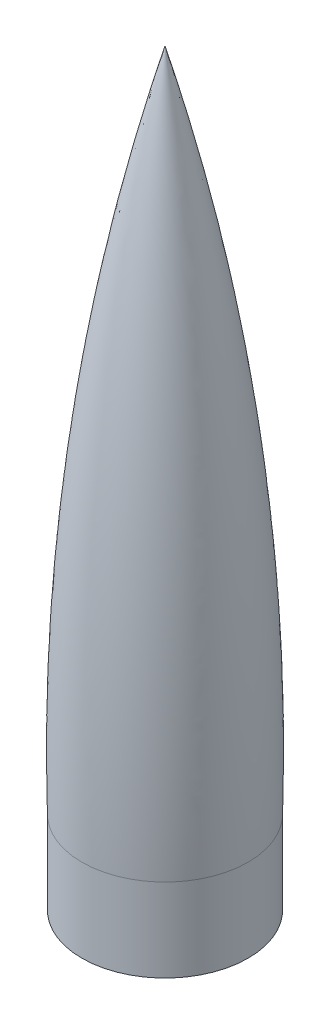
ISO-10303-21;
HEADER;
FILE_DESCRIPTION(('STEP AP214'),'2;1');
FILE_NAME('part.step','',(''),(''),'','','');
FILE_SCHEMA(('AUTOMOTIVE_DESIGN { 1 0 10303 214 1 1 1 1 }'));
ENDSEC;
DATA;
#1=APPLICATION_CONTEXT('core data for automotive mechanical design processes');
#2=APPLICATION_PROTOCOL_DEFINITION('international standard','automotive_design',2000,#1);
#3=PRODUCT_CONTEXT('',#1,'mechanical');
#4=PRODUCT('Part','Part','',(#3));
#5=PRODUCT_RELATED_PRODUCT_CATEGORY('part','',(#4));
#6=PRODUCT_DEFINITION_FORMATION('','',#4);
#7=PRODUCT_DEFINITION_CONTEXT('part definition',#1,'design');
#8=PRODUCT_DEFINITION('design','',#6,#7);
#9=PRODUCT_DEFINITION_SHAPE('','',#8);
#10=(LENGTH_UNIT() NAMED_UNIT(*) SI_UNIT(.MILLI.,.METRE.));
#11=(NAMED_UNIT(*) PLANE_ANGLE_UNIT() SI_UNIT($,.RADIAN.));
#12=(NAMED_UNIT(*) SI_UNIT($,.STERADIAN.) SOLID_ANGLE_UNIT());
#13=UNCERTAINTY_MEASURE_WITH_UNIT(LENGTH_MEASURE(1.E-05),#10,'distance_accuracy_value','');
#14=(GEOMETRIC_REPRESENTATION_CONTEXT(3) GLOBAL_UNCERTAINTY_ASSIGNED_CONTEXT((#13)) GLOBAL_UNIT_ASSIGNED_CONTEXT((#10,
#11,#12)) REPRESENTATION_CONTEXT('',''));
#15=CARTESIAN_POINT('',(0.,0.,0.));
#16=DIRECTION('',(0.,0.,1.));
#17=DIRECTION('',(1.,0.,0.));
#18=AXIS2_PLACEMENT_3D('',#15,#16,#17);
#19=CARTESIAN_POINT('',(0.,25.363989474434,-997.238084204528));
#20=DIRECTION('',(-1.,0.,0.));
#21=DIRECTION('',(0.,0.,1.));
#22=AXIS2_PLACEMENT_3D('',#19,#20,#21);
#23=CIRCLE('',#22,1035.64872450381);
#24=TRIMMED_CURVE('',#23,(PARAMETER_VALUE(-0.273203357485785)),
(PARAMETER_VALUE(0.273203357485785)),.T.,.PARAMETER.);
#25=CARTESIAN_POINT('',(0.,25.363989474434,0.));
#26=DIRECTION('',(0.,1.,0.));
#27=AXIS1_PLACEMENT('',#25,#26);
#28=SURFACE_OF_REVOLUTION('',#24,#27);
#29=CARTESIAN_POINT('',(0.,304.8,0.));
#30=VERTEX_POINT('',#29);
#31=VERTEX_LOOP('',#30);
#32=FACE_BOUND('',#31,.T.);
#33=CARTESIAN_POINT('',(0.,0.,0.));
#34=DIRECTION('',(0.,-1.,0.));
#35=DIRECTION('',(0.,0.,-1.));
#36=AXIS2_PLACEMENT_3D('',#33,#34,#35);
#37=CIRCLE('',#36,38.1);
#38=CARTESIAN_POINT('',(0.,0.,38.1));
#39=VERTEX_POINT('',#38);
#40=EDGE_CURVE('E85',#39,#39,#37,.T.);
#41=ORIENTED_EDGE('',*,*,#40,.F.);
#42=EDGE_LOOP('',(#41));
#43=FACE_BOUND('',#42,.T.);
#44=ADVANCED_FACE('F45',(#32,#43),#28,.T.);
#45=CARTESIAN_POINT('',(0.,-38.1,0.));
#46=DIRECTION('',(0.,-1.,0.));
#47=DIRECTION('',(0.,0.,-1.));
#48=AXIS2_PLACEMENT_3D('',#45,#46,#47);
#49=PLANE('',#48);
#50=CARTESIAN_POINT('',(0.,-38.1,0.));
#51=DIRECTION('',(0.,-1.,0.));
#52=DIRECTION('',(0.,0.,-1.));
#53=AXIS2_PLACEMENT_3D('',#50,#51,#52);
#54=CIRCLE('',#53,38.1);
#55=CARTESIAN_POINT('',(0.,-38.1,38.1));
#56=VERTEX_POINT('',#55);
#57=EDGE_CURVE('E53',#56,#56,#54,.T.);
#58=ORIENTED_EDGE('',*,*,#57,.T.);
#59=EDGE_LOOP('',(#58));
#60=FACE_BOUND('',#59,.T.);
#61=CARTESIAN_POINT('',(0.,-38.1,0.));
#62=DIRECTION('',(0.,-1.,0.));
#63=DIRECTION('',(0.,0.,-1.));
#64=AXIS2_PLACEMENT_3D('',#61,#62,#63);
#65=CIRCLE('',#64,34.9240444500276);
#66=CARTESIAN_POINT('',(0.,-38.1,34.9240444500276));
#67=VERTEX_POINT('',#66);
#68=EDGE_CURVE('E88',#67,#67,#65,.T.);
#69=ORIENTED_EDGE('',*,*,#68,.F.);
#70=EDGE_LOOP('',(#69));
#71=FACE_BOUND('',#70,.T.);
#72=ADVANCED_FACE('F72',(#60,#71),#49,.T.);
#73=CARTESIAN_POINT('',(0.,-38.1,0.));
#74=DIRECTION('',(0.,1.,0.));
#75=DIRECTION('',(0.,0.,1.));
#76=AXIS2_PLACEMENT_3D('',#73,#74,#75);
#77=CYLINDRICAL_SURFACE('',#76,38.1);
#78=CARTESIAN_POINT('',(0.,-38.1,38.1));
#79=CARTESIAN_POINT('',(0.,-37.703125,38.1));
#80=CARTESIAN_POINT('',(0.,-37.30625,38.1));
#81=CARTESIAN_POINT('',(0.,-36.5125,38.1));
#82=CARTESIAN_POINT('',(0.,-36.115625,38.1));
#83=CARTESIAN_POINT('',(0.,-35.321875,38.1));
#84=CARTESIAN_POINT('',(0.,-34.925,38.1));
#85=CARTESIAN_POINT('',(0.,-34.13125,38.1));
#86=CARTESIAN_POINT('',(0.,-33.734375,38.1));
#87=CARTESIAN_POINT('',(0.,-32.940625,38.1));
#88=CARTESIAN_POINT('',(0.,-32.54375,38.1));
#89=CARTESIAN_POINT('',(0.,-31.75,38.1));
#90=CARTESIAN_POINT('',(0.,-31.353125,38.1));
#91=CARTESIAN_POINT('',(0.,-30.559375,38.1));
#92=CARTESIAN_POINT('',(0.,-30.1625,38.1));
#93=CARTESIAN_POINT('',(0.,-29.36875,38.1));
#94=CARTESIAN_POINT('',(0.,-28.971875,38.1));
#95=CARTESIAN_POINT('',(0.,-28.178125,38.1));
#96=CARTESIAN_POINT('',(0.,-27.78125,38.1));
#97=CARTESIAN_POINT('',(0.,-26.9875,38.1));
#98=CARTESIAN_POINT('',(0.,-26.590625,38.1));
#99=CARTESIAN_POINT('',(0.,-25.796875,38.1));
#100=CARTESIAN_POINT('',(0.,-25.4,38.1));
#101=CARTESIAN_POINT('',(0.,-24.60625,38.1));
#102=CARTESIAN_POINT('',(0.,-24.209375,38.1));
#103=CARTESIAN_POINT('',(0.,-23.415625,38.1));
#104=CARTESIAN_POINT('',(0.,-23.01875,38.1));
#105=CARTESIAN_POINT('',(0.,-22.225,38.1));
#106=CARTESIAN_POINT('',(0.,-21.828125,38.1));
#107=CARTESIAN_POINT('',(0.,-21.034375,38.1));
#108=CARTESIAN_POINT('',(0.,-20.6375,38.1));
#109=CARTESIAN_POINT('',(0.,-19.84375,38.1));
#110=CARTESIAN_POINT('',(0.,-19.446875,38.1));
#111=CARTESIAN_POINT('',(0.,-18.653125,38.1));
#112=CARTESIAN_POINT('',(0.,-18.25625,38.1));
#113=CARTESIAN_POINT('',(0.,-17.4625,38.1));
#114=CARTESIAN_POINT('',(0.,-17.065625,38.1));
#115=CARTESIAN_POINT('',(0.,-16.271875,38.1));
#116=CARTESIAN_POINT('',(0.,-15.875,38.1));
#117=CARTESIAN_POINT('',(0.,-15.08125,38.1));
#118=CARTESIAN_POINT('',(0.,-14.684375,38.1));
#119=CARTESIAN_POINT('',(0.,-13.890625,38.1));
#120=CARTESIAN_POINT('',(0.,-13.49375,38.1));
#121=CARTESIAN_POINT('',(0.,-12.7,38.1));
#122=CARTESIAN_POINT('',(0.,-12.303125,38.1));
#123=CARTESIAN_POINT('',(0.,-11.509375,38.1));
#124=CARTESIAN_POINT('',(0.,-11.1125,38.1));
#125=CARTESIAN_POINT('',(0.,-10.31875,38.1));
#126=CARTESIAN_POINT('',(0.,-9.92187499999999,38.1));
#127=CARTESIAN_POINT('',(0.,-9.128125,38.1));
#128=CARTESIAN_POINT('',(0.,-8.73124999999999,38.1));
#129=CARTESIAN_POINT('',(0.,-7.93749999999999,38.1));
#130=CARTESIAN_POINT('',(0.,-7.54062499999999,38.1));
#131=CARTESIAN_POINT('',(0.,-6.746875,38.1));
#132=CARTESIAN_POINT('',(0.,-6.35,38.1));
#133=CARTESIAN_POINT('',(0.,-5.55625,38.1));
#134=CARTESIAN_POINT('',(0.,-5.159375,38.1));
#135=CARTESIAN_POINT('',(0.,-4.365625,38.1));
#136=CARTESIAN_POINT('',(0.,-3.96875,38.1));
#137=CARTESIAN_POINT('',(0.,-3.175,38.1));
#138=CARTESIAN_POINT('',(0.,-2.778125,38.1));
#139=CARTESIAN_POINT('',(0.,-1.984375,38.1));
#140=CARTESIAN_POINT('',(0.,-1.5875,38.1));
#141=CARTESIAN_POINT('',(0.,-0.79375,38.1));
#142=CARTESIAN_POINT('',(0.,-0.396875,38.1));
#143=CARTESIAN_POINT('',(0.,0.,38.1));
#144=B_SPLINE_CURVE_WITH_KNOTS('',3,(#78,#79,#80,#81,#82,#83,#84,#85,#86,#87,#88,#89,#90,#91,
#92,#93,#94,#95,#96,#97,#98,#99,#100,#101,#102,#103,#104,#105,#106,#107,#108,#109,#110,#111,
#112,#113,#114,#115,#116,#117,#118,#119,#120,#121,#122,#123,#124,#125,#126,#127,#128,#129,#130,
#131,#132,#133,#134,#135,#136,#137,#138,#139,#140,#141,#142,#143),.UNSPECIFIED.,.F.,.F.,(4,2,2,
2,2,2,2,2,2,2,2,2,2,2,2,2,2,2,2,2,2,2,2,2,2,2,2,2,2,2,2,2,4),(0.,1.190625,2.38125,3.571875,
4.7625,5.953125,7.14375,8.334375,9.52500000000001,10.715625,11.90625,13.096875,14.2875,
15.478125,16.66875,17.859375,19.05,20.240625,21.43125,22.621875,23.8125,25.003125,26.19375,
27.384375,28.575,29.765625,30.95625,32.146875,33.3375,34.528125,35.71875,36.909375,38.1),.UNSPECIFIED.);
#145=EDGE_CURVE('BSEAM66',#56,#39,#144,.T.);
#146=ORIENTED_EDGE('',*,*,#57,.F.);
#147=ORIENTED_EDGE('',*,*,#40,.T.);
#148=ORIENTED_EDGE('',*,*,#145,.T.);
#149=ORIENTED_EDGE('',*,*,#145,.F.);
#150=EDGE_LOOP('',(#146,#148,#147,#149));
#151=FACE_BOUND('',#150,.T.);
#152=ADVANCED_FACE('F66',(#151),#77,.T.);
#153=CARTESIAN_POINT('',(0.,-38.1,0.));
#154=DIRECTION('',(0.,1.,0.));
#155=DIRECTION('',(0.,0.,1.));
#156=AXIS2_PLACEMENT_3D('',#153,#154,#155);
#157=CYLINDRICAL_SURFACE('',#156,34.9240444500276);
#158=CARTESIAN_POINT('',(0.,1.70002900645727E-13,0.));
#159=DIRECTION('',(0.,1.,0.));
#160=DIRECTION('',(0.,0.,1.));
#161=AXIS2_PLACEMENT_3D('',#158,#159,#160);
#162=CIRCLE('',#161,34.9240444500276);
#163=CARTESIAN_POINT('',(0.,1.66533453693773E-13,34.9240444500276));
#164=VERTEX_POINT('',#163);
#165=EDGE_CURVE('E11',#164,#164,#162,.T.);
#166=CARTESIAN_POINT('',(0.,-38.1,34.9240444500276));
#167=CARTESIAN_POINT('',(0.,-37.703125,34.9240444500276));
#168=CARTESIAN_POINT('',(0.,-37.30625,34.9240444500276));
#169=CARTESIAN_POINT('',(0.,-36.5125,34.9240444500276));
#170=CARTESIAN_POINT('',(0.,-36.115625,34.9240444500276));
#171=CARTESIAN_POINT('',(0.,-35.321875,34.9240444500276));
#172=CARTESIAN_POINT('',(0.,-34.925,34.9240444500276));
#173=CARTESIAN_POINT('',(0.,-34.13125,34.9240444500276));
#174=CARTESIAN_POINT('',(0.,-33.734375,34.9240444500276));
#175=CARTESIAN_POINT('',(0.,-32.940625,34.9240444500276));
#176=CARTESIAN_POINT('',(0.,-32.54375,34.9240444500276));
#177=CARTESIAN_POINT('',(0.,-31.75,34.9240444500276));
#178=CARTESIAN_POINT('',(0.,-31.353125,34.9240444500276));
#179=CARTESIAN_POINT('',(0.,-30.559375,34.9240444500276));
#180=CARTESIAN_POINT('',(0.,-30.1625,34.9240444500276));
#181=CARTESIAN_POINT('',(0.,-29.36875,34.9240444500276));
#182=CARTESIAN_POINT('',(0.,-28.971875,34.9240444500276));
#183=CARTESIAN_POINT('',(0.,-28.178125,34.9240444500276));
#184=CARTESIAN_POINT('',(0.,-27.78125,34.9240444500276));
#185=CARTESIAN_POINT('',(0.,-26.9874999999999,34.9240444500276));
#186=CARTESIAN_POINT('',(0.,-26.5906249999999,34.9240444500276));
#187=CARTESIAN_POINT('',(0.,-25.7968749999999,34.9240444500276));
#188=CARTESIAN_POINT('',(0.,-25.3999999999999,34.9240444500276));
#189=CARTESIAN_POINT('',(0.,-24.6062499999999,34.9240444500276));
#190=CARTESIAN_POINT('',(0.,-24.2093749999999,34.9240444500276));
#191=CARTESIAN_POINT('',(0.,-23.4156249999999,34.9240444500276));
#192=CARTESIAN_POINT('',(0.,-23.0187499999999,34.9240444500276));
#193=CARTESIAN_POINT('',(0.,-22.2249999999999,34.9240444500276));
#194=CARTESIAN_POINT('',(0.,-21.8281249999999,34.9240444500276));
#195=CARTESIAN_POINT('',(0.,-21.0343749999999,34.9240444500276));
#196=CARTESIAN_POINT('',(0.,-20.6374999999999,34.9240444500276));
#197=CARTESIAN_POINT('',(0.,-19.8437499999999,34.9240444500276));
#198=CARTESIAN_POINT('',(0.,-19.4468749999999,34.9240444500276));
#199=CARTESIAN_POINT('',(0.,-18.6531249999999,34.9240444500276));
#200=CARTESIAN_POINT('',(0.,-18.2562499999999,34.9240444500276));
#201=CARTESIAN_POINT('',(0.,-17.4624999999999,34.9240444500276));
#202=CARTESIAN_POINT('',(0.,-17.0656249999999,34.9240444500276));
#203=CARTESIAN_POINT('',(0.,-16.2718749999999,34.9240444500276));
#204=CARTESIAN_POINT('',(0.,-15.8749999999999,34.9240444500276));
#205=CARTESIAN_POINT('',(0.,-15.0812499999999,34.9240444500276));
#206=CARTESIAN_POINT('',(0.,-14.6843749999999,34.9240444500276));
#207=CARTESIAN_POINT('',(0.,-13.8906249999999,34.9240444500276));
#208=CARTESIAN_POINT('',(0.,-13.4937499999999,34.9240444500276));
#209=CARTESIAN_POINT('',(0.,-12.6999999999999,34.9240444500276));
#210=CARTESIAN_POINT('',(0.,-12.3031249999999,34.9240444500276));
#211=CARTESIAN_POINT('',(0.,-11.5093749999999,34.9240444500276));
#212=CARTESIAN_POINT('',(0.,-11.1124999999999,34.9240444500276));
#213=CARTESIAN_POINT('',(0.,-10.3187499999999,34.9240444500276));
#214=CARTESIAN_POINT('',(0.,-9.92187499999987,34.9240444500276));
#215=CARTESIAN_POINT('',(0.,-9.12812499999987,34.9240444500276));
#216=CARTESIAN_POINT('',(0.,-8.73124999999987,34.9240444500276));
#217=CARTESIAN_POINT('',(0.,-7.93749999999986,34.9240444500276));
#218=CARTESIAN_POINT('',(0.,-7.54062499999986,34.9240444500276));
#219=CARTESIAN_POINT('',(0.,-6.74687499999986,34.9240444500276));
#220=CARTESIAN_POINT('',(0.,-6.34999999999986,34.9240444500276));
#221=CARTESIAN_POINT('',(0.,-5.55624999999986,34.9240444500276));
#222=CARTESIAN_POINT('',(0.,-5.15937499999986,34.9240444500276));
#223=CARTESIAN_POINT('',(0.,-4.36562499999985,34.9240444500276));
#224=CARTESIAN_POINT('',(0.,-3.96874999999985,34.9240444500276));
#225=CARTESIAN_POINT('',(0.,-3.17499999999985,34.9240444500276));
#226=CARTESIAN_POINT('',(0.,-2.77812499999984,34.9240444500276));
#227=CARTESIAN_POINT('',(0.,-1.98437499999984,34.9240444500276));
#228=CARTESIAN_POINT('',(0.,-1.58749999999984,34.9240444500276));
#229=CARTESIAN_POINT('',(0.,-0.793749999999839,34.9240444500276));
#230=CARTESIAN_POINT('',(0.,-0.396874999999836,34.9240444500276));
#231=CARTESIAN_POINT('',(0.,1.66533453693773E-13,34.9240444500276));
#232=B_SPLINE_CURVE_WITH_KNOTS('',3,(#166,#167,#168,#169,#170,#171,#172,#173,#174,#175,#176,
#177,#178,#179,#180,#181,#182,#183,#184,#185,#186,#187,#188,#189,#190,#191,#192,#193,#194,#195,
#196,#197,#198,#199,#200,#201,#202,#203,#204,#205,#206,#207,#208,#209,#210,#211,#212,#213,#214,
#215,#216,#217,#218,#219,#220,#221,#222,#223,#224,#225,#226,#227,#228,#229,#230,#231),
.UNSPECIFIED.,.F.,.F.,(4,2,2,2,2,2,2,2,2,2,2,2,2,2,2,2,2,2,2,2,2,2,2,2,2,2,2,2,2,2,2,2,4),(0.,
1.19062500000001,2.38125000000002,3.57187500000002,4.76250000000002,5.95312500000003,
7.14375000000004,8.33437500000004,9.52500000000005,10.7156250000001,11.9062500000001,
13.0968750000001,14.2875000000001,15.4781250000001,16.6687500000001,17.8593750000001,
19.0500000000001,20.2406250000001,21.4312500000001,22.6218750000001,23.8125000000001,
25.0031250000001,26.1937500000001,27.3843750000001,28.5750000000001,29.7656250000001,
30.9562500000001,32.1468750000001,33.3375000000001,34.5281250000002,35.7187500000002,
36.9093750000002,38.1000000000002),.UNSPECIFIED.);
#233=EDGE_CURVE('BSEAM62',#67,#164,#232,.T.);
#234=ORIENTED_EDGE('',*,*,#68,.T.);
#235=ORIENTED_EDGE('',*,*,#165,.T.);
#236=ORIENTED_EDGE('',*,*,#233,.T.);
#237=ORIENTED_EDGE('',*,*,#233,.F.);
#238=EDGE_LOOP('',(#234,#236,#235,#237));
#239=FACE_BOUND('',#238,.T.);
#240=ADVANCED_FACE('F62',(#239),#157,.F.);
#241=CARTESIAN_POINT('',(0.,25.363989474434,-997.238084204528));
#242=DIRECTION('',(-1.,0.,0.));
#243=DIRECTION('',(0.,0.,1.));
#244=AXIS2_PLACEMENT_3D('',#241,#242,#243);
#245=CIRCLE('',#244,1032.47372450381);
#246=TRIMMED_CURVE('',#245,(PARAMETER_VALUE(-0.262004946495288)),
(PARAMETER_VALUE(0.262004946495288)),.T.,.PARAMETER.);
#247=CARTESIAN_POINT('',(0.,25.363989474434,0.));
#248=DIRECTION('',(0.,1.,0.));
#249=AXIS1_PLACEMENT('',#247,#248);
#250=SURFACE_OF_REVOLUTION('',#246,#249);
#251=CARTESIAN_POINT('',(0.,292.792849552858,0.));
#252=VERTEX_POINT('',#251);
#253=VERTEX_LOOP('',#252);
#254=FACE_BOUND('',#253,.T.);
#255=ORIENTED_EDGE('',*,*,#165,.F.);
#256=EDGE_LOOP('',(#255));
#257=FACE_BOUND('',#256,.T.);
#258=ADVANCED_FACE('F59',(#254,#257),#250,.F.);
#259=CLOSED_SHELL('',(#44,#72,#152,#240,#258));
#260=MANIFOLD_SOLID_BREP('B2',#259);
#261=ADVANCED_BREP_SHAPE_REPRESENTATION('',(#18,#260),#14);
#262=SHAPE_DEFINITION_REPRESENTATION(#9,#261);
ENDSEC;
END-ISO-10303-21;
